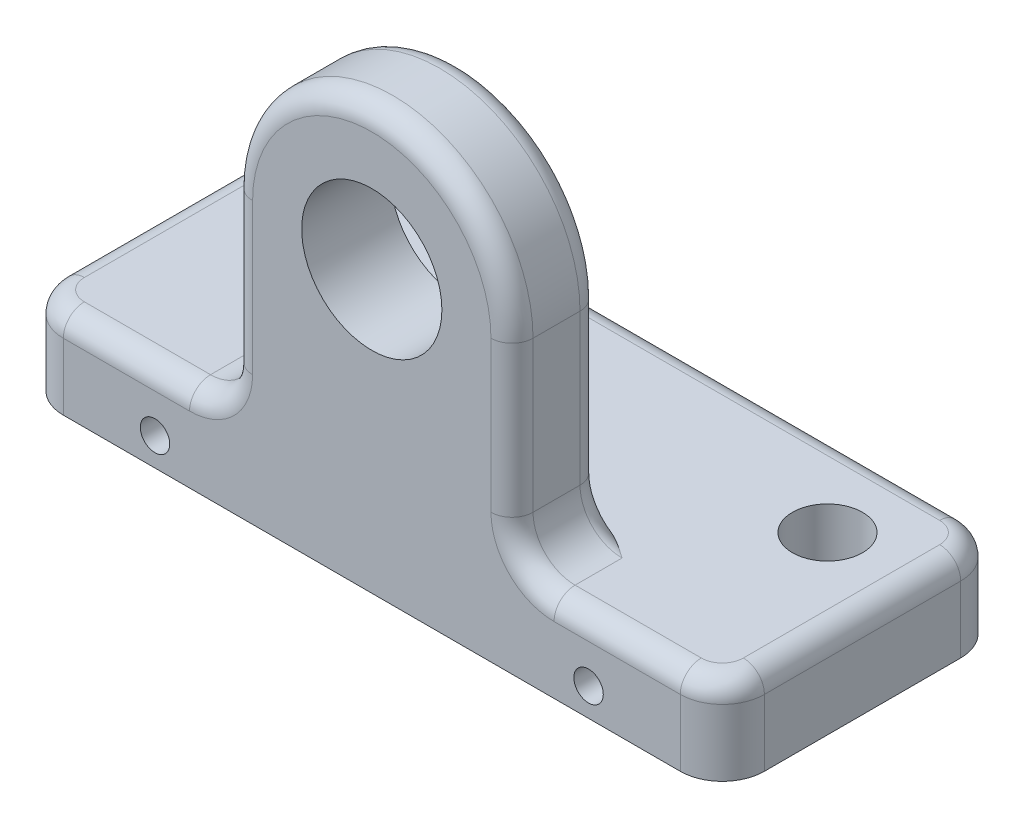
ISO-10303-21;
HEADER;
FILE_DESCRIPTION(('STEP AP214'),'2;1');
FILE_NAME('part.step','',(''),(''),'','','');
FILE_SCHEMA(('AUTOMOTIVE_DESIGN { 1 0 10303 214 1 1 1 1 }'));
ENDSEC;
DATA;
#1=APPLICATION_CONTEXT('core data for automotive mechanical design processes');
#2=APPLICATION_PROTOCOL_DEFINITION('international standard','automotive_design',2000,#1);
#3=PRODUCT_CONTEXT('',#1,'mechanical');
#4=PRODUCT('Part','Part','',(#3));
#5=PRODUCT_RELATED_PRODUCT_CATEGORY('part','',(#4));
#6=PRODUCT_DEFINITION_FORMATION('','',#4);
#7=PRODUCT_DEFINITION_CONTEXT('part definition',#1,'design');
#8=PRODUCT_DEFINITION('design','',#6,#7);
#9=PRODUCT_DEFINITION_SHAPE('','',#8);
#10=(LENGTH_UNIT() NAMED_UNIT(*) SI_UNIT(.MILLI.,.METRE.));
#11=(NAMED_UNIT(*) PLANE_ANGLE_UNIT() SI_UNIT($,.RADIAN.));
#12=(NAMED_UNIT(*) SI_UNIT($,.STERADIAN.) SOLID_ANGLE_UNIT());
#13=UNCERTAINTY_MEASURE_WITH_UNIT(LENGTH_MEASURE(1.E-05),#10,'distance_accuracy_value','');
#14=(GEOMETRIC_REPRESENTATION_CONTEXT(3) GLOBAL_UNCERTAINTY_ASSIGNED_CONTEXT((#13)) GLOBAL_UNIT_ASSIGNED_CONTEXT((#10,
#11,#12)) REPRESENTATION_CONTEXT('',''));
#15=CARTESIAN_POINT('',(0.,0.,0.));
#16=DIRECTION('',(0.,0.,1.));
#17=DIRECTION('',(1.,0.,0.));
#18=AXIS2_PLACEMENT_3D('',#15,#16,#17);
#19=CARTESIAN_POINT('',(-50.,12.5,-20.));
#20=DIRECTION('',(1.,0.,0.));
#21=DIRECTION('',(0.,0.,-1.));
#22=AXIS2_PLACEMENT_3D('',#19,#20,#21);
#23=PLANE('',#22);
#24=DIRECTION('',(0.,-1.,0.));
#25=VECTOR('',#24,1.);
#26=CARTESIAN_POINT('',(-50.,12.5,14.));
#27=LINE('',#26,#25);
#28=CARTESIAN_POINT('',(-50.,0.,14.));
#29=VERTEX_POINT('',#28);
#30=CARTESIAN_POINT('',(-50.,9.5,14.));
#31=VERTEX_POINT('',#30);
#32=EDGE_CURVE('E654',#29,#31,#27,.F.);
#33=ORIENTED_EDGE('',*,*,#32,.T.);
#34=DIRECTION('',(0.,0.,1.));
#35=VECTOR('',#34,1.);
#36=CARTESIAN_POINT('',(-50.,9.5,-14.));
#37=LINE('',#36,#35);
#38=CARTESIAN_POINT('',(-50.,9.5,-14.));
#39=VERTEX_POINT('',#38);
#40=EDGE_CURVE('E707',#31,#39,#37,.F.);
#41=ORIENTED_EDGE('',*,*,#40,.T.);
#42=DIRECTION('',(0.,-1.,0.));
#43=VECTOR('',#42,1.);
#44=CARTESIAN_POINT('',(-50.,12.5,-14.));
#45=LINE('',#44,#43);
#46=CARTESIAN_POINT('',(-50.,0.,-14.));
#47=VERTEX_POINT('',#46);
#48=EDGE_CURVE('E652',#39,#47,#45,.T.);
#49=ORIENTED_EDGE('',*,*,#48,.T.);
#50=DIRECTION('',(0.,0.,1.));
#51=VECTOR('',#50,1.);
#52=CARTESIAN_POINT('',(-50.,0.,-20.));
#53=LINE('',#52,#51);
#54=EDGE_CURVE('E611',#47,#29,#53,.T.);
#55=ORIENTED_EDGE('',*,*,#54,.T.);
#56=EDGE_LOOP('',(#33,#41,#49,#55));
#57=FACE_BOUND('',#56,.T.);
#58=ADVANCED_FACE('F351',(#57),#23,.F.);
#59=CARTESIAN_POINT('',(-50.,12.5,20.));
#60=DIRECTION('',(0.,0.,-1.));
#61=DIRECTION('',(-1.,0.,0.));
#62=AXIS2_PLACEMENT_3D('',#59,#60,#61);
#63=PLANE('',#62);
#64=CARTESIAN_POINT('',(-30.9212159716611,4.,20.));
#65=DIRECTION('',(0.,0.,1.));
#66=DIRECTION('',(1.,0.,0.));
#67=AXIS2_PLACEMENT_3D('',#64,#65,#66);
#68=CIRCLE('',#67,2.09999999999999);
#69=CARTESIAN_POINT('',(-28.8212159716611,4.,20.));
#70=VERTEX_POINT('',#69);
#71=EDGE_CURVE('E526',#70,#70,#68,.T.);
#72=ORIENTED_EDGE('',*,*,#71,.F.);
#73=EDGE_LOOP('',(#72));
#74=FACE_BOUND('',#73,.T.);
#75=CARTESIAN_POINT('',(30.9212159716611,4.,20.));
#76=DIRECTION('',(0.,0.,1.));
#77=DIRECTION('',(1.,0.,0.));
#78=AXIS2_PLACEMENT_3D('',#75,#76,#77);
#79=CIRCLE('',#78,2.09999999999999);
#80=CARTESIAN_POINT('',(33.0212159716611,4.,20.));
#81=VERTEX_POINT('',#80);
#82=EDGE_CURVE('E534',#81,#81,#79,.T.);
#83=ORIENTED_EDGE('',*,*,#82,.F.);
#84=EDGE_LOOP('',(#83));
#85=FACE_BOUND('',#84,.T.);
#86=CARTESIAN_POINT('',(0.,40.,20.));
#87=DIRECTION('',(0.,0.,1.));
#88=DIRECTION('',(1.,0.,0.));
#89=AXIS2_PLACEMENT_3D('',#86,#87,#88);
#90=CIRCLE('',#89,10.);
#91=CARTESIAN_POINT('',(10.,40.,20.));
#92=VERTEX_POINT('',#91);
#93=EDGE_CURVE('E549',#92,#92,#90,.T.);
#94=ORIENTED_EDGE('',*,*,#93,.F.);
#95=EDGE_LOOP('',(#94));
#96=FACE_BOUND('',#95,.T.);
#97=CARTESIAN_POINT('',(-26.,18.5,20.));
#98=DIRECTION('',(0.,0.,-1.));
#99=DIRECTION('',(-1.,0.,0.));
#100=AXIS2_PLACEMENT_3D('',#97,#98,#99);
#101=CIRCLE('',#100,9.);
#102=CARTESIAN_POINT('',(-17.,18.5,20.));
#103=VERTEX_POINT('',#102);
#104=CARTESIAN_POINT('',(-26.,9.5,20.));
#105=VERTEX_POINT('',#104);
#106=EDGE_CURVE('E679',#103,#105,#101,.T.);
#107=ORIENTED_EDGE('',*,*,#106,.T.);
#108=DIRECTION('',(1.,0.,0.));
#109=VECTOR('',#108,1.);
#110=CARTESIAN_POINT('',(-44.,9.5,20.));
#111=LINE('',#110,#109);
#112=CARTESIAN_POINT('',(-44.,9.5,20.));
#113=VERTEX_POINT('',#112);
#114=EDGE_CURVE('E681',#105,#113,#111,.F.);
#115=ORIENTED_EDGE('',*,*,#114,.T.);
#116=DIRECTION('',(0.,-1.,0.));
#117=VECTOR('',#116,1.);
#118=CARTESIAN_POINT('',(-44.,12.5,20.));
#119=LINE('',#118,#117);
#120=CARTESIAN_POINT('',(-44.,0.,20.));
#121=VERTEX_POINT('',#120);
#122=EDGE_CURVE('E636',#113,#121,#119,.T.);
#123=ORIENTED_EDGE('',*,*,#122,.T.);
#124=DIRECTION('',(1.,0.,0.));
#125=VECTOR('',#124,1.);
#126=CARTESIAN_POINT('',(-50.,0.,20.));
#127=LINE('',#126,#125);
#128=CARTESIAN_POINT('',(44.,0.,20.));
#129=VERTEX_POINT('',#128);
#130=EDGE_CURVE('E614',#121,#129,#127,.T.);
#131=ORIENTED_EDGE('',*,*,#130,.T.);
#132=DIRECTION('',(0.,-1.,0.));
#133=VECTOR('',#132,1.);
#134=CARTESIAN_POINT('',(44.,12.5,20.));
#135=LINE('',#134,#133);
#136=CARTESIAN_POINT('',(44.,9.5,20.));
#137=VERTEX_POINT('',#136);
#138=EDGE_CURVE('E638',#129,#137,#135,.F.);
#139=ORIENTED_EDGE('',*,*,#138,.T.);
#140=DIRECTION('',(1.,0.,0.));
#141=VECTOR('',#140,1.);
#142=CARTESIAN_POINT('',(26.,9.5,20.));
#143=LINE('',#142,#141);
#144=CARTESIAN_POINT('',(26.,9.5,20.));
#145=VERTEX_POINT('',#144);
#146=EDGE_CURVE('E674',#137,#145,#143,.F.);
#147=ORIENTED_EDGE('',*,*,#146,.T.);
#148=CARTESIAN_POINT('',(26.,18.5,20.));
#149=DIRECTION('',(0.,0.,-1.));
#150=DIRECTION('',(-1.,0.,0.));
#151=AXIS2_PLACEMENT_3D('',#148,#149,#150);
#152=CIRCLE('',#151,9.);
#153=CARTESIAN_POINT('',(17.,18.5,20.));
#154=VERTEX_POINT('',#153);
#155=EDGE_CURVE('E672',#145,#154,#152,.T.);
#156=ORIENTED_EDGE('',*,*,#155,.T.);
#157=DIRECTION('',(0.,-1.,0.));
#158=VECTOR('',#157,1.);
#159=CARTESIAN_POINT('',(17.,12.5,20.));
#160=LINE('',#159,#158);
#161=CARTESIAN_POINT('',(17.,40.,20.));
#162=VERTEX_POINT('',#161);
#163=EDGE_CURVE('E670',#154,#162,#160,.F.);
#164=ORIENTED_EDGE('',*,*,#163,.T.);
#165=CARTESIAN_POINT('',(0.,40.,20.));
#166=DIRECTION('',(0.,0.,-1.));
#167=DIRECTION('',(-1.,0.,0.));
#168=AXIS2_PLACEMENT_3D('',#165,#166,#167);
#169=CIRCLE('',#168,17.);
#170=CARTESIAN_POINT('',(-17.,40.,20.));
#171=VERTEX_POINT('',#170);
#172=EDGE_CURVE('E668',#162,#171,#169,.F.);
#173=ORIENTED_EDGE('',*,*,#172,.T.);
#174=DIRECTION('',(0.,1.,0.));
#175=VECTOR('',#174,1.);
#176=CARTESIAN_POINT('',(-17.,12.5,20.));
#177=LINE('',#176,#175);
#178=EDGE_CURVE('E676',#171,#103,#177,.F.);
#179=ORIENTED_EDGE('',*,*,#178,.T.);
#180=EDGE_LOOP('',(#107,#115,#123,#131,#139,#147,#156,#164,#173,#179));
#181=FACE_BOUND('',#180,.T.);
#182=ADVANCED_FACE('F883',(#74,#85,#96,#181),#63,.F.);
#183=CARTESIAN_POINT('',(50.,12.5,-20.));
#184=DIRECTION('',(-1.,0.,0.));
#185=DIRECTION('',(0.,0.,1.));
#186=AXIS2_PLACEMENT_3D('',#183,#184,#185);
#187=PLANE('',#186);
#188=DIRECTION('',(0.,-1.,0.));
#189=VECTOR('',#188,1.);
#190=CARTESIAN_POINT('',(50.,12.5,-14.));
#191=LINE('',#190,#189);
#192=CARTESIAN_POINT('',(50.,0.,-14.));
#193=VERTEX_POINT('',#192);
#194=CARTESIAN_POINT('',(50.,9.5,-14.));
#195=VERTEX_POINT('',#194);
#196=EDGE_CURVE('E623',#193,#195,#191,.F.);
#197=ORIENTED_EDGE('',*,*,#196,.T.);
#198=DIRECTION('',(0.,0.,-1.));
#199=VECTOR('',#198,1.);
#200=CARTESIAN_POINT('',(50.,9.5,14.));
#201=LINE('',#200,#199);
#202=CARTESIAN_POINT('',(50.,9.5,14.));
#203=VERTEX_POINT('',#202);
#204=EDGE_CURVE('E715',#195,#203,#201,.F.);
#205=ORIENTED_EDGE('',*,*,#204,.T.);
#206=DIRECTION('',(0.,-1.,0.));
#207=VECTOR('',#206,1.);
#208=CARTESIAN_POINT('',(50.,12.5,14.));
#209=LINE('',#208,#207);
#210=CARTESIAN_POINT('',(50.,0.,14.));
#211=VERTEX_POINT('',#210);
#212=EDGE_CURVE('E626',#203,#211,#209,.T.);
#213=ORIENTED_EDGE('',*,*,#212,.T.);
#214=DIRECTION('',(0.,0.,-1.));
#215=VECTOR('',#214,1.);
#216=CARTESIAN_POINT('',(50.,0.,-20.));
#217=LINE('',#216,#215);
#218=EDGE_CURVE('E617',#211,#193,#217,.T.);
#219=ORIENTED_EDGE('',*,*,#218,.T.);
#220=EDGE_LOOP('',(#197,#205,#213,#219));
#221=FACE_BOUND('',#220,.T.);
#222=ADVANCED_FACE('F889',(#221),#187,.F.);
#223=CARTESIAN_POINT('',(-50.,12.5,-20.));
#224=DIRECTION('',(0.,0.,1.));
#225=DIRECTION('',(1.,0.,0.));
#226=AXIS2_PLACEMENT_3D('',#223,#224,#225);
#227=PLANE('',#226);
#228=DIRECTION('',(0.,-1.,0.));
#229=VECTOR('',#228,1.);
#230=CARTESIAN_POINT('',(-44.,12.5,-20.));
#231=LINE('',#230,#229);
#232=CARTESIAN_POINT('',(-44.,0.,-20.));
#233=VERTEX_POINT('',#232);
#234=CARTESIAN_POINT('',(-44.,9.5,-20.));
#235=VERTEX_POINT('',#234);
#236=EDGE_CURVE('E647',#233,#235,#231,.F.);
#237=ORIENTED_EDGE('',*,*,#236,.T.);
#238=DIRECTION('',(-1.,0.,0.));
#239=VECTOR('',#238,1.);
#240=CARTESIAN_POINT('',(44.,9.5,-20.));
#241=LINE('',#240,#239);
#242=CARTESIAN_POINT('',(44.,9.5,-20.));
#243=VERTEX_POINT('',#242);
#244=EDGE_CURVE('E711',#235,#243,#241,.F.);
#245=ORIENTED_EDGE('',*,*,#244,.T.);
#246=DIRECTION('',(0.,-1.,0.));
#247=VECTOR('',#246,1.);
#248=CARTESIAN_POINT('',(44.,12.5,-20.));
#249=LINE('',#248,#247);
#250=CARTESIAN_POINT('',(44.,0.,-20.));
#251=VERTEX_POINT('',#250);
#252=EDGE_CURVE('E650',#243,#251,#249,.T.);
#253=ORIENTED_EDGE('',*,*,#252,.T.);
#254=DIRECTION('',(-1.,0.,0.));
#255=VECTOR('',#254,1.);
#256=CARTESIAN_POINT('',(-50.,0.,-20.));
#257=LINE('',#256,#255);
#258=EDGE_CURVE('E620',#251,#233,#257,.T.);
#259=ORIENTED_EDGE('',*,*,#258,.T.);
#260=EDGE_LOOP('',(#237,#245,#253,#259));
#261=FACE_BOUND('',#260,.T.);
#262=ADVANCED_FACE('F879',(#261),#227,.F.);
#263=CARTESIAN_POINT('',(-50.,12.5,20.));
#264=DIRECTION('',(0.,1.,0.));
#265=DIRECTION('',(0.,0.,1.));
#266=AXIS2_PLACEMENT_3D('',#263,#264,#265);
#267=PLANE('',#266);
#268=CARTESIAN_POINT('',(-37.5,12.5,-7.49999999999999));
#269=DIRECTION('',(0.,1.,0.));
#270=DIRECTION('',(0.,0.,1.));
#271=AXIS2_PLACEMENT_3D('',#268,#269,#270);
#272=CIRCLE('',#271,5.);
#273=CARTESIAN_POINT('',(-37.5,12.5,-2.5));
#274=VERTEX_POINT('',#273);
#275=EDGE_CURVE('E537',#274,#274,#272,.T.);
#276=ORIENTED_EDGE('',*,*,#275,.F.);
#277=EDGE_LOOP('',(#276));
#278=FACE_BOUND('',#277,.T.);
#279=CARTESIAN_POINT('',(37.5,12.5,-7.50000000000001));
#280=DIRECTION('',(0.,1.,0.));
#281=DIRECTION('',(0.,0.,1.));
#282=AXIS2_PLACEMENT_3D('',#279,#280,#281);
#283=CIRCLE('',#282,5.);
#284=CARTESIAN_POINT('',(37.5,12.5,-2.50000000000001));
#285=VERTEX_POINT('',#284);
#286=EDGE_CURVE('E543',#285,#285,#283,.T.);
#287=ORIENTED_EDGE('',*,*,#286,.F.);
#288=EDGE_LOOP('',(#287));
#289=FACE_BOUND('',#288,.T.);
#290=CARTESIAN_POINT('',(-44.,12.5,14.));
#291=DIRECTION('',(0.,1.,0.));
#292=DIRECTION('',(0.,0.,1.));
#293=AXIS2_PLACEMENT_3D('',#290,#291,#292);
#294=CIRCLE('',#293,3.);
#295=CARTESIAN_POINT('',(-47.,12.5,14.));
#296=VERTEX_POINT('',#295);
#297=CARTESIAN_POINT('',(-44.,12.5,17.));
#298=VERTEX_POINT('',#297);
#299=EDGE_CURVE('E701',#296,#298,#294,.T.);
#300=ORIENTED_EDGE('',*,*,#299,.T.);
#301=DIRECTION('',(1.,0.,0.));
#302=VECTOR('',#301,1.);
#303=CARTESIAN_POINT('',(-26.,12.5,17.));
#304=LINE('',#303,#302);
#305=CARTESIAN_POINT('',(-26.,12.5,17.));
#306=VERTEX_POINT('',#305);
#307=EDGE_CURVE('E703',#298,#306,#304,.T.);
#308=ORIENTED_EDGE('',*,*,#307,.T.);
#309=DIRECTION('',(0.,0.,1.));
#310=VECTOR('',#309,1.);
#311=CARTESIAN_POINT('',(-26.,12.5,20.));
#312=LINE('',#311,#310);
#313=CARTESIAN_POINT('',(-26.,12.5,10.3));
#314=VERTEX_POINT('',#313);
#315=EDGE_CURVE('E644',#306,#314,#312,.F.);
#316=ORIENTED_EDGE('',*,*,#315,.T.);
#317=CARTESIAN_POINT('',(-19.2917960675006,12.5,7.3));
#318=CARTESIAN_POINT('',(-19.4699847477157,12.5,7.30001536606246));
#319=CARTESIAN_POINT('',(-19.6479605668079,12.5,7.30881435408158));
#320=CARTESIAN_POINT('',(-20.0021021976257,12.5,7.34213005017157));
#321=CARTESIAN_POINT('',(-20.1782709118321,12.5,7.36661536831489));
#322=CARTESIAN_POINT('',(-20.6971961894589,12.5,7.45984128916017));
#323=CARTESIAN_POINT('',(-21.0364046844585,12.5,7.54848248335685));
#324=CARTESIAN_POINT('',(-21.7323783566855,12.5,7.77705288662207));
#325=CARTESIAN_POINT('',(-22.0877437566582,12.5,7.92105909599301));
#326=CARTESIAN_POINT('',(-22.7822471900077,12.5,8.24436110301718));
#327=CARTESIAN_POINT('',(-23.1213600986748,12.5,8.42370947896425));
#328=CARTESIAN_POINT('',(-23.7887153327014,12.5,8.80771609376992));
#329=CARTESIAN_POINT('',(-24.1168315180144,12.5,9.01258868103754));
#330=CARTESIAN_POINT('',(-24.7635387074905,12.5,9.43627356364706));
#331=CARTESIAN_POINT('',(-25.0821339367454,12.5,9.65507953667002));
#332=CARTESIAN_POINT('',(-25.5955053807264,12.5,10.0140134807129));
#333=CARTESIAN_POINT('',(-25.7914347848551,12.5,10.1525228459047));
#334=CARTESIAN_POINT('',(-25.991567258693,12.5,10.2940371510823));
#335=CARTESIAN_POINT('',(-25.9957836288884,12.5,10.2970185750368));
#336=CARTESIAN_POINT('',(-26.,12.5,10.3));
#337=B_SPLINE_CURVE_WITH_KNOTS('',3,(#317,#318,#319,#320,#321,#322,#323,#324,#325,#326,#327,
#328,#329,#330,#331,#332,#333,#334,#335,#336),.UNSPECIFIED.,.F.,.F.,(4,2,2,2,2,2,2,2,2,4),(0.,
0.534020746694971,1.06697618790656,2.11500888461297,3.26274547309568,4.41220261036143,
5.57206146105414,6.73139772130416,7.45123837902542,7.46673031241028),.UNSPECIFIED.);
#338=CARTESIAN_POINT('',(-19.2917960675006,12.5,7.3));
#339=VERTEX_POINT('',#338);
#340=EDGE_CURVE('E359',#314,#339,#337,.F.);
#341=ORIENTED_EDGE('',*,*,#340,.T.);
#342=DIRECTION('',(-1.,0.,0.));
#343=VECTOR('',#342,1.);
#344=CARTESIAN_POINT('',(20.,12.5,7.3));
#345=LINE('',#344,#343);
#346=CARTESIAN_POINT('',(19.2917960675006,12.5,7.3));
#347=VERTEX_POINT('',#346);
#348=EDGE_CURVE('E602',#347,#339,#345,.T.);
#349=ORIENTED_EDGE('',*,*,#348,.F.);
#350=CARTESIAN_POINT('',(19.2917960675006,12.5,7.3));
#351=CARTESIAN_POINT('',(19.4699847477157,12.5,7.30001536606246));
#352=CARTESIAN_POINT('',(19.6479605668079,12.5,7.30881435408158));
#353=CARTESIAN_POINT('',(20.0021021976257,12.5,7.34213005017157));
#354=CARTESIAN_POINT('',(20.1782709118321,12.5,7.36661536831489));
#355=CARTESIAN_POINT('',(20.6971961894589,12.5,7.45984128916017));
#356=CARTESIAN_POINT('',(21.0364046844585,12.5,7.54848248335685));
#357=CARTESIAN_POINT('',(21.7323783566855,12.5,7.77705288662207));
#358=CARTESIAN_POINT('',(22.0877437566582,12.5,7.92105909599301));
#359=CARTESIAN_POINT('',(22.7822471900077,12.5,8.24436110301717));
#360=CARTESIAN_POINT('',(23.1213600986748,12.5,8.42370947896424));
#361=CARTESIAN_POINT('',(23.7887153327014,12.5,8.80771609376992));
#362=CARTESIAN_POINT('',(24.1168315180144,12.5,9.01258868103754));
#363=CARTESIAN_POINT('',(24.7635387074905,12.5,9.43627356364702));
#364=CARTESIAN_POINT('',(25.0821339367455,12.5,9.65507953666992));
#365=CARTESIAN_POINT('',(25.5955053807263,12.5,10.014013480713));
#366=CARTESIAN_POINT('',(25.791434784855,12.5,10.1525228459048));
#367=CARTESIAN_POINT('',(25.991567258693,12.5,10.2940371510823));
#368=CARTESIAN_POINT('',(25.9957836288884,12.5,10.2970185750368));
#369=CARTESIAN_POINT('',(26.,12.5,10.3));
#370=B_SPLINE_CURVE_WITH_KNOTS('',3,(#350,#351,#352,#353,#354,#355,#356,#357,#358,#359,#360,
#361,#362,#363,#364,#365,#366,#367,#368,#369),.UNSPECIFIED.,.F.,.F.,(4,2,2,2,2,2,2,2,2,4),(0.,
0.534020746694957,1.06697618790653,2.11500888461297,3.26274547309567,4.41220261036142,
5.57206146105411,6.7313977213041,7.45123837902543,7.46673031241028),.UNSPECIFIED.);
#371=CARTESIAN_POINT('',(26.,12.5,10.3));
#372=VERTEX_POINT('',#371);
#373=EDGE_CURVE('E11',#347,#372,#370,.T.);
#374=ORIENTED_EDGE('',*,*,#373,.T.);
#375=DIRECTION('',(0.,0.,1.));
#376=VECTOR('',#375,1.);
#377=CARTESIAN_POINT('',(26.,12.5,20.));
#378=LINE('',#377,#376);
#379=CARTESIAN_POINT('',(26.,12.5,17.));
#380=VERTEX_POINT('',#379);
#381=EDGE_CURVE('E641',#372,#380,#378,.T.);
#382=ORIENTED_EDGE('',*,*,#381,.T.);
#383=DIRECTION('',(1.,0.,0.));
#384=VECTOR('',#383,1.);
#385=CARTESIAN_POINT('',(44.,12.5,17.));
#386=LINE('',#385,#384);
#387=CARTESIAN_POINT('',(44.,12.5,17.));
#388=VERTEX_POINT('',#387);
#389=EDGE_CURVE('E687',#380,#388,#386,.T.);
#390=ORIENTED_EDGE('',*,*,#389,.T.);
#391=CARTESIAN_POINT('',(44.,12.5,14.));
#392=DIRECTION('',(0.,1.,0.));
#393=DIRECTION('',(0.,0.,1.));
#394=AXIS2_PLACEMENT_3D('',#391,#392,#393);
#395=CIRCLE('',#394,3.);
#396=CARTESIAN_POINT('',(47.,12.5,14.));
#397=VERTEX_POINT('',#396);
#398=EDGE_CURVE('E689',#388,#397,#395,.T.);
#399=ORIENTED_EDGE('',*,*,#398,.T.);
#400=DIRECTION('',(0.,0.,-1.));
#401=VECTOR('',#400,1.);
#402=CARTESIAN_POINT('',(47.,12.5,-14.));
#403=LINE('',#402,#401);
#404=CARTESIAN_POINT('',(47.,12.5,-14.));
#405=VERTEX_POINT('',#404);
#406=EDGE_CURVE('E691',#397,#405,#403,.T.);
#407=ORIENTED_EDGE('',*,*,#406,.T.);
#408=CARTESIAN_POINT('',(44.,12.5,-14.));
#409=DIRECTION('',(0.,1.,0.));
#410=DIRECTION('',(0.,0.,1.));
#411=AXIS2_PLACEMENT_3D('',#408,#409,#410);
#412=CIRCLE('',#411,3.);
#413=CARTESIAN_POINT('',(44.,12.5,-17.));
#414=VERTEX_POINT('',#413);
#415=EDGE_CURVE('E693',#405,#414,#412,.T.);
#416=ORIENTED_EDGE('',*,*,#415,.T.);
#417=DIRECTION('',(-1.,0.,0.));
#418=VECTOR('',#417,1.);
#419=CARTESIAN_POINT('',(-44.,12.5,-17.));
#420=LINE('',#419,#418);
#421=CARTESIAN_POINT('',(-44.,12.5,-17.));
#422=VERTEX_POINT('',#421);
#423=EDGE_CURVE('E695',#414,#422,#420,.T.);
#424=ORIENTED_EDGE('',*,*,#423,.T.);
#425=CARTESIAN_POINT('',(-44.,12.5,-14.));
#426=DIRECTION('',(0.,1.,0.));
#427=DIRECTION('',(0.,0.,1.));
#428=AXIS2_PLACEMENT_3D('',#425,#426,#427);
#429=CIRCLE('',#428,3.);
#430=CARTESIAN_POINT('',(-47.,12.5,-14.));
#431=VERTEX_POINT('',#430);
#432=EDGE_CURVE('E697',#422,#431,#429,.T.);
#433=ORIENTED_EDGE('',*,*,#432,.T.);
#434=DIRECTION('',(0.,0.,1.));
#435=VECTOR('',#434,1.);
#436=CARTESIAN_POINT('',(-47.,12.5,14.));
#437=LINE('',#436,#435);
#438=EDGE_CURVE('E699',#431,#296,#437,.T.);
#439=ORIENTED_EDGE('',*,*,#438,.T.);
#440=EDGE_LOOP('',(#300,#308,#316,#341,#349,#374,#382,#390,#399,#407,#416,#424,#433,#439));
#441=FACE_BOUND('',#440,.T.);
#442=ADVANCED_FACE('F750',(#278,#289,#441),#267,.T.);
#443=CARTESIAN_POINT('',(-50.,0.,20.));
#444=DIRECTION('',(0.,1.,0.));
#445=DIRECTION('',(0.,0.,1.));
#446=AXIS2_PLACEMENT_3D('',#443,#444,#445);
#447=PLANE('',#446);
#448=CARTESIAN_POINT('',(-37.5,0.,-7.49999999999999));
#449=DIRECTION('',(0.,1.,0.));
#450=DIRECTION('',(0.,0.,1.));
#451=AXIS2_PLACEMENT_3D('',#448,#449,#450);
#452=CIRCLE('',#451,5.);
#453=CARTESIAN_POINT('',(-37.5,0.,-2.5));
#454=VERTEX_POINT('',#453);
#455=EDGE_CURVE('E540',#454,#454,#452,.T.);
#456=ORIENTED_EDGE('',*,*,#455,.T.);
#457=EDGE_LOOP('',(#456));
#458=FACE_BOUND('',#457,.T.);
#459=CARTESIAN_POINT('',(37.5,0.,-7.50000000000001));
#460=DIRECTION('',(0.,1.,0.));
#461=DIRECTION('',(0.,0.,1.));
#462=AXIS2_PLACEMENT_3D('',#459,#460,#461);
#463=CIRCLE('',#462,5.);
#464=CARTESIAN_POINT('',(37.5,0.,-2.50000000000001));
#465=VERTEX_POINT('',#464);
#466=EDGE_CURVE('E546',#465,#465,#463,.T.);
#467=ORIENTED_EDGE('',*,*,#466,.T.);
#468=EDGE_LOOP('',(#467));
#469=FACE_BOUND('',#468,.T.);
#470=ORIENTED_EDGE('',*,*,#218,.F.);
#471=CARTESIAN_POINT('',(44.,0.,14.));
#472=DIRECTION('',(0.,1.,0.));
#473=DIRECTION('',(0.,0.,1.));
#474=AXIS2_PLACEMENT_3D('',#471,#472,#473);
#475=CIRCLE('',#474,6.);
#476=EDGE_CURVE('E634',#211,#129,#475,.F.);
#477=ORIENTED_EDGE('',*,*,#476,.T.);
#478=ORIENTED_EDGE('',*,*,#130,.F.);
#479=CARTESIAN_POINT('',(-44.,0.,14.));
#480=DIRECTION('',(0.,1.,0.));
#481=DIRECTION('',(0.,0.,1.));
#482=AXIS2_PLACEMENT_3D('',#479,#480,#481);
#483=CIRCLE('',#482,6.);
#484=EDGE_CURVE('E630',#121,#29,#483,.F.);
#485=ORIENTED_EDGE('',*,*,#484,.T.);
#486=ORIENTED_EDGE('',*,*,#54,.F.);
#487=CARTESIAN_POINT('',(-44.,0.,-14.));
#488=DIRECTION('',(0.,1.,0.));
#489=DIRECTION('',(0.,0.,1.));
#490=AXIS2_PLACEMENT_3D('',#487,#488,#489);
#491=CIRCLE('',#490,6.);
#492=EDGE_CURVE('E628',#47,#233,#491,.F.);
#493=ORIENTED_EDGE('',*,*,#492,.T.);
#494=ORIENTED_EDGE('',*,*,#258,.F.);
#495=CARTESIAN_POINT('',(44.,0.,-14.));
#496=DIRECTION('',(0.,1.,0.));
#497=DIRECTION('',(0.,0.,1.));
#498=AXIS2_PLACEMENT_3D('',#495,#496,#497);
#499=CIRCLE('',#498,6.);
#500=EDGE_CURVE('E632',#251,#193,#499,.F.);
#501=ORIENTED_EDGE('',*,*,#500,.T.);
#502=EDGE_LOOP('',(#470,#477,#478,#485,#486,#493,#494,#501));
#503=FACE_BOUND('',#502,.T.);
#504=ADVANCED_FACE('F871',(#458,#469,#503),#447,.F.);
#505=CARTESIAN_POINT('',(-20.,12.5,7.3));
#506=DIRECTION('',(1.,0.,0.));
#507=DIRECTION('',(0.,1.,0.));
#508=AXIS2_PLACEMENT_3D('',#505,#506,#507);
#509=PLANE('',#508);
#510=DIRECTION('',(0.,0.,1.));
#511=VECTOR('',#510,1.);
#512=CARTESIAN_POINT('',(-20.,18.5,7.3));
#513=LINE('',#512,#511);
#514=CARTESIAN_POINT('',(-20.,18.5,10.3));
#515=VERTEX_POINT('',#514);
#516=CARTESIAN_POINT('',(-20.,18.5,17.));
#517=VERTEX_POINT('',#516);
#518=EDGE_CURVE('E657',#515,#517,#513,.T.);
#519=ORIENTED_EDGE('',*,*,#518,.T.);
#520=DIRECTION('',(0.,1.,0.));
#521=VECTOR('',#520,1.);
#522=CARTESIAN_POINT('',(-20.,12.5,17.));
#523=LINE('',#522,#521);
#524=CARTESIAN_POINT('',(-20.,40.,17.));
#525=VERTEX_POINT('',#524);
#526=EDGE_CURVE('E665',#517,#525,#523,.T.);
#527=ORIENTED_EDGE('',*,*,#526,.T.);
#528=DIRECTION('',(0.,0.,1.));
#529=VECTOR('',#528,1.);
#530=CARTESIAN_POINT('',(-20.,40.,7.3));
#531=LINE('',#530,#529);
#532=CARTESIAN_POINT('',(-20.,40.,10.3));
#533=VERTEX_POINT('',#532);
#534=EDGE_CURVE('E608',#533,#525,#531,.T.);
#535=ORIENTED_EDGE('',*,*,#534,.F.);
#536=DIRECTION('',(0.,1.,0.));
#537=VECTOR('',#536,1.);
#538=CARTESIAN_POINT('',(-20.,18.5,10.3));
#539=LINE('',#538,#537);
#540=EDGE_CURVE('E663',#533,#515,#539,.F.);
#541=ORIENTED_EDGE('',*,*,#540,.T.);
#542=EDGE_LOOP('',(#519,#527,#535,#541));
#543=FACE_BOUND('',#542,.T.);
#544=ADVANCED_FACE('F868',(#543),#509,.F.);
#545=CARTESIAN_POINT('',(0.,40.,7.3));
#546=DIRECTION('',(0.,0.,1.));
#547=DIRECTION('',(1.,0.,0.));
#548=AXIS2_PLACEMENT_3D('',#545,#546,#547);
#549=CYLINDRICAL_SURFACE('',#548,20.);
#550=ORIENTED_EDGE('',*,*,#534,.T.);
#551=CARTESIAN_POINT('',(0.,40.,17.));
#552=DIRECTION('',(0.,0.,-1.));
#553=DIRECTION('',(-1.,0.,0.));
#554=AXIS2_PLACEMENT_3D('',#551,#552,#553);
#555=CIRCLE('',#554,20.);
#556=CARTESIAN_POINT('',(20.,40.,17.));
#557=VERTEX_POINT('',#556);
#558=EDGE_CURVE('E739',#525,#557,#555,.T.);
#559=ORIENTED_EDGE('',*,*,#558,.T.);
#560=DIRECTION('',(0.,0.,1.));
#561=VECTOR('',#560,1.);
#562=CARTESIAN_POINT('',(20.,40.,7.3));
#563=LINE('',#562,#561);
#564=CARTESIAN_POINT('',(20.,40.,10.3));
#565=VERTEX_POINT('',#564);
#566=EDGE_CURVE('E605',#565,#557,#563,.T.);
#567=ORIENTED_EDGE('',*,*,#566,.F.);
#568=CARTESIAN_POINT('',(0.,40.,10.3));
#569=DIRECTION('',(0.,0.,-1.));
#570=DIRECTION('',(-1.,0.,0.));
#571=AXIS2_PLACEMENT_3D('',#568,#569,#570);
#572=CIRCLE('',#571,20.);
#573=EDGE_CURVE('E737',#565,#533,#572,.F.);
#574=ORIENTED_EDGE('',*,*,#573,.T.);
#575=EDGE_LOOP('',(#550,#559,#567,#574));
#576=FACE_BOUND('',#575,.T.);
#577=ADVANCED_FACE('F864',(#576),#549,.T.);
#578=CARTESIAN_POINT('',(20.,40.,7.3));
#579=DIRECTION('',(-1.,0.,0.));
#580=DIRECTION('',(0.,-1.,0.));
#581=AXIS2_PLACEMENT_3D('',#578,#579,#580);
#582=PLANE('',#581);
#583=ORIENTED_EDGE('',*,*,#566,.T.);
#584=DIRECTION('',(0.,-1.,0.));
#585=VECTOR('',#584,1.);
#586=CARTESIAN_POINT('',(20.,40.,17.));
#587=LINE('',#586,#585);
#588=CARTESIAN_POINT('',(20.,18.5,17.));
#589=VERTEX_POINT('',#588);
#590=EDGE_CURVE('E725',#557,#589,#587,.T.);
#591=ORIENTED_EDGE('',*,*,#590,.T.);
#592=DIRECTION('',(0.,0.,1.));
#593=VECTOR('',#592,1.);
#594=CARTESIAN_POINT('',(20.,18.5,7.3));
#595=LINE('',#594,#593);
#596=CARTESIAN_POINT('',(20.,18.5,10.3));
#597=VERTEX_POINT('',#596);
#598=EDGE_CURVE('E660',#589,#597,#595,.F.);
#599=ORIENTED_EDGE('',*,*,#598,.T.);
#600=DIRECTION('',(0.,-1.,0.));
#601=VECTOR('',#600,1.);
#602=CARTESIAN_POINT('',(20.,40.,10.3));
#603=LINE('',#602,#601);
#604=EDGE_CURVE('E723',#597,#565,#603,.F.);
#605=ORIENTED_EDGE('',*,*,#604,.T.);
#606=EDGE_LOOP('',(#583,#591,#599,#605));
#607=FACE_BOUND('',#606,.T.);
#608=ADVANCED_FACE('F860',(#607),#582,.F.);
#609=CARTESIAN_POINT('',(0.,40.,7.3));
#610=DIRECTION('',(0.,0.,-1.));
#611=DIRECTION('',(-1.,0.,0.));
#612=AXIS2_PLACEMENT_3D('',#609,#610,#611);
#613=PLANE('',#612);
#614=CARTESIAN_POINT('',(0.,40.,7.3));
#615=DIRECTION('',(0.,0.,-1.));
#616=DIRECTION('',(-1.,0.,0.));
#617=AXIS2_PLACEMENT_3D('',#614,#615,#616);
#618=CIRCLE('',#617,10.);
#619=CARTESIAN_POINT('',(-10.,40.,7.3));
#620=VERTEX_POINT('',#619);
#621=EDGE_CURVE('E354',#620,#620,#618,.T.);
#622=ORIENTED_EDGE('',*,*,#621,.F.);
#623=EDGE_LOOP('',(#622));
#624=FACE_BOUND('',#623,.T.);
#625=ORIENTED_EDGE('',*,*,#348,.T.);
#626=CARTESIAN_POINT('',(-26.,18.5,7.3));
#627=DIRECTION('',(0.,0.,-1.));
#628=DIRECTION('',(-1.,0.,0.));
#629=AXIS2_PLACEMENT_3D('',#626,#627,#628);
#630=CIRCLE('',#629,9.);
#631=CARTESIAN_POINT('',(-17.,18.5,7.3));
#632=VERTEX_POINT('',#631);
#633=EDGE_CURVE('E734',#339,#632,#630,.F.);
#634=ORIENTED_EDGE('',*,*,#633,.T.);
#635=DIRECTION('',(0.,1.,0.));
#636=VECTOR('',#635,1.);
#637=CARTESIAN_POINT('',(-17.,40.,7.3));
#638=LINE('',#637,#636);
#639=CARTESIAN_POINT('',(-17.,40.,7.3));
#640=VERTEX_POINT('',#639);
#641=EDGE_CURVE('E732',#632,#640,#638,.T.);
#642=ORIENTED_EDGE('',*,*,#641,.T.);
#643=CARTESIAN_POINT('',(0.,40.,7.3));
#644=DIRECTION('',(0.,0.,-1.));
#645=DIRECTION('',(-1.,0.,0.));
#646=AXIS2_PLACEMENT_3D('',#643,#644,#645);
#647=CIRCLE('',#646,17.);
#648=CARTESIAN_POINT('',(17.,40.,7.3));
#649=VERTEX_POINT('',#648);
#650=EDGE_CURVE('E727',#640,#649,#647,.T.);
#651=ORIENTED_EDGE('',*,*,#650,.T.);
#652=DIRECTION('',(0.,-1.,0.));
#653=VECTOR('',#652,1.);
#654=CARTESIAN_POINT('',(17.,18.5,7.3));
#655=LINE('',#654,#653);
#656=CARTESIAN_POINT('',(17.,18.5,7.3));
#657=VERTEX_POINT('',#656);
#658=EDGE_CURVE('E374',#649,#657,#655,.T.);
#659=ORIENTED_EDGE('',*,*,#658,.T.);
#660=CARTESIAN_POINT('',(26.,18.5,7.3));
#661=DIRECTION('',(0.,0.,-1.));
#662=DIRECTION('',(-1.,0.,0.));
#663=AXIS2_PLACEMENT_3D('',#660,#661,#662);
#664=CIRCLE('',#663,9.);
#665=EDGE_CURVE('E730',#657,#347,#664,.F.);
#666=ORIENTED_EDGE('',*,*,#665,.T.);
#667=EDGE_LOOP('',(#625,#634,#642,#651,#659,#666));
#668=FACE_BOUND('',#667,.T.);
#669=ADVANCED_FACE('F856',(#624,#668),#613,.T.);
#670=CARTESIAN_POINT('',(44.,12.5,14.));
#671=DIRECTION('',(0.,-1.,0.));
#672=DIRECTION('',(0.,0.,-1.));
#673=AXIS2_PLACEMENT_3D('',#670,#671,#672);
#674=CYLINDRICAL_SURFACE('',#673,6.);
#675=ORIENTED_EDGE('',*,*,#212,.F.);
#676=CARTESIAN_POINT('',(44.,9.5,14.));
#677=DIRECTION('',(0.,1.,0.));
#678=DIRECTION('',(0.,0.,1.));
#679=AXIS2_PLACEMENT_3D('',#676,#677,#678);
#680=CIRCLE('',#679,6.);
#681=EDGE_CURVE('E717',#203,#137,#680,.F.);
#682=ORIENTED_EDGE('',*,*,#681,.T.);
#683=ORIENTED_EDGE('',*,*,#138,.F.);
#684=ORIENTED_EDGE('',*,*,#476,.F.);
#685=EDGE_LOOP('',(#675,#682,#683,#684));
#686=FACE_BOUND('',#685,.T.);
#687=ADVANCED_FACE('F852',(#686),#674,.T.);
#688=CARTESIAN_POINT('',(44.,12.5,-14.));
#689=DIRECTION('',(0.,-1.,0.));
#690=DIRECTION('',(0.,0.,-1.));
#691=AXIS2_PLACEMENT_3D('',#688,#689,#690);
#692=CYLINDRICAL_SURFACE('',#691,6.);
#693=ORIENTED_EDGE('',*,*,#252,.F.);
#694=CARTESIAN_POINT('',(44.,9.5,-14.));
#695=DIRECTION('',(0.,1.,0.));
#696=DIRECTION('',(0.,0.,1.));
#697=AXIS2_PLACEMENT_3D('',#694,#695,#696);
#698=CIRCLE('',#697,6.);
#699=EDGE_CURVE('E713',#243,#195,#698,.F.);
#700=ORIENTED_EDGE('',*,*,#699,.T.);
#701=ORIENTED_EDGE('',*,*,#196,.F.);
#702=ORIENTED_EDGE('',*,*,#500,.F.);
#703=EDGE_LOOP('',(#693,#700,#701,#702));
#704=FACE_BOUND('',#703,.T.);
#705=ADVANCED_FACE('F848',(#704),#692,.T.);
#706=CARTESIAN_POINT('',(-44.,12.5,14.));
#707=DIRECTION('',(0.,-1.,0.));
#708=DIRECTION('',(0.,0.,-1.));
#709=AXIS2_PLACEMENT_3D('',#706,#707,#708);
#710=CYLINDRICAL_SURFACE('',#709,6.);
#711=ORIENTED_EDGE('',*,*,#122,.F.);
#712=CARTESIAN_POINT('',(-44.,9.5,14.));
#713=DIRECTION('',(0.,1.,0.));
#714=DIRECTION('',(0.,0.,1.));
#715=AXIS2_PLACEMENT_3D('',#712,#713,#714);
#716=CIRCLE('',#715,6.);
#717=EDGE_CURVE('E705',#113,#31,#716,.F.);
#718=ORIENTED_EDGE('',*,*,#717,.T.);
#719=ORIENTED_EDGE('',*,*,#32,.F.);
#720=ORIENTED_EDGE('',*,*,#484,.F.);
#721=EDGE_LOOP('',(#711,#718,#719,#720));
#722=FACE_BOUND('',#721,.T.);
#723=ADVANCED_FACE('F844',(#722),#710,.T.);
#724=CARTESIAN_POINT('',(-44.,12.5,-14.));
#725=DIRECTION('',(0.,-1.,0.));
#726=DIRECTION('',(0.,0.,-1.));
#727=AXIS2_PLACEMENT_3D('',#724,#725,#726);
#728=CYLINDRICAL_SURFACE('',#727,6.);
#729=ORIENTED_EDGE('',*,*,#48,.F.);
#730=CARTESIAN_POINT('',(-44.,9.5,-14.));
#731=DIRECTION('',(0.,1.,0.));
#732=DIRECTION('',(0.,0.,1.));
#733=AXIS2_PLACEMENT_3D('',#730,#731,#732);
#734=CIRCLE('',#733,6.);
#735=EDGE_CURVE('E709',#39,#235,#734,.F.);
#736=ORIENTED_EDGE('',*,*,#735,.T.);
#737=ORIENTED_EDGE('',*,*,#236,.F.);
#738=ORIENTED_EDGE('',*,*,#492,.F.);
#739=EDGE_LOOP('',(#729,#736,#737,#738));
#740=FACE_BOUND('',#739,.T.);
#741=ADVANCED_FACE('F840',(#740),#728,.T.);
#742=CARTESIAN_POINT('',(-26.,18.5,7.3));
#743=DIRECTION('',(0.,0.,1.));
#744=DIRECTION('',(1.,0.,0.));
#745=AXIS2_PLACEMENT_3D('',#742,#743,#744);
#746=CYLINDRICAL_SURFACE('',#745,6.);
#747=ORIENTED_EDGE('',*,*,#315,.F.);
#748=CARTESIAN_POINT('',(-26.,18.5,17.));
#749=DIRECTION('',(0.,0.,-1.));
#750=DIRECTION('',(-1.,0.,0.));
#751=AXIS2_PLACEMENT_3D('',#748,#749,#750);
#752=CIRCLE('',#751,6.);
#753=EDGE_CURVE('E685',#306,#517,#752,.F.);
#754=ORIENTED_EDGE('',*,*,#753,.T.);
#755=ORIENTED_EDGE('',*,*,#518,.F.);
#756=CARTESIAN_POINT('',(-26.,18.5,10.3));
#757=DIRECTION('',(0.,0.,-1.));
#758=DIRECTION('',(-1.,0.,0.));
#759=AXIS2_PLACEMENT_3D('',#756,#757,#758);
#760=CIRCLE('',#759,6.);
#761=EDGE_CURVE('E683',#515,#314,#760,.T.);
#762=ORIENTED_EDGE('',*,*,#761,.T.);
#763=EDGE_LOOP('',(#747,#754,#755,#762));
#764=FACE_BOUND('',#763,.T.);
#765=ADVANCED_FACE('F836',(#764),#746,.F.);
#766=CARTESIAN_POINT('',(26.,18.5,20.));
#767=DIRECTION('',(0.,0.,1.));
#768=DIRECTION('',(1.,0.,0.));
#769=AXIS2_PLACEMENT_3D('',#766,#767,#768);
#770=CYLINDRICAL_SURFACE('',#769,6.);
#771=ORIENTED_EDGE('',*,*,#598,.F.);
#772=CARTESIAN_POINT('',(26.,18.5,17.));
#773=DIRECTION('',(0.,0.,-1.));
#774=DIRECTION('',(-1.,0.,0.));
#775=AXIS2_PLACEMENT_3D('',#772,#773,#774);
#776=CIRCLE('',#775,6.);
#777=EDGE_CURVE('E721',#589,#380,#776,.F.);
#778=ORIENTED_EDGE('',*,*,#777,.T.);
#779=ORIENTED_EDGE('',*,*,#381,.F.);
#780=CARTESIAN_POINT('',(26.,18.5,10.3));
#781=DIRECTION('',(0.,0.,-1.));
#782=DIRECTION('',(-1.,0.,0.));
#783=AXIS2_PLACEMENT_3D('',#780,#781,#782);
#784=CIRCLE('',#783,6.);
#785=EDGE_CURVE('E719',#372,#597,#784,.T.);
#786=ORIENTED_EDGE('',*,*,#785,.T.);
#787=EDGE_LOOP('',(#771,#778,#779,#786));
#788=FACE_BOUND('',#787,.T.);
#789=ADVANCED_FACE('F832',(#788),#770,.F.);
#790=CARTESIAN_POINT('',(44.,9.5,-14.));
#791=DIRECTION('',(0.,1.,0.));
#792=DIRECTION('',(0.,0.,1.));
#793=AXIS2_PLACEMENT_3D('',#790,#791,#792);
#794=DEGENERATE_TOROIDAL_SURFACE('',#793,3.,3.,.T.);
#795=CARTESIAN_POINT('',(47.,9.5,-14.));
#796=DIRECTION('',(0.,0.,1.));
#797=DIRECTION('',(1.,0.,0.));
#798=AXIS2_PLACEMENT_3D('',#795,#796,#797);
#799=CIRCLE('',#798,3.);
#800=EDGE_CURVE('E596',#195,#405,#799,.T.);
#801=ORIENTED_EDGE('',*,*,#800,.F.);
#802=ORIENTED_EDGE('',*,*,#699,.F.);
#803=CARTESIAN_POINT('',(44.,9.5,-17.));
#804=DIRECTION('',(-1.,0.,0.));
#805=DIRECTION('',(0.,0.,1.));
#806=AXIS2_PLACEMENT_3D('',#803,#804,#805);
#807=CIRCLE('',#806,3.);
#808=EDGE_CURVE('E599',#414,#243,#807,.T.);
#809=ORIENTED_EDGE('',*,*,#808,.F.);
#810=ORIENTED_EDGE('',*,*,#415,.F.);
#811=EDGE_LOOP('',(#801,#802,#809,#810));
#812=FACE_BOUND('',#811,.T.);
#813=ADVANCED_FACE('F828',(#812),#794,.T.);
#814=CARTESIAN_POINT('',(-50.,9.5,-17.));
#815=DIRECTION('',(1.,0.,0.));
#816=DIRECTION('',(0.,0.,-1.));
#817=AXIS2_PLACEMENT_3D('',#814,#815,#816);
#818=CYLINDRICAL_SURFACE('',#817,3.);
#819=ORIENTED_EDGE('',*,*,#808,.T.);
#820=ORIENTED_EDGE('',*,*,#244,.F.);
#821=CARTESIAN_POINT('',(-44.,9.5,-17.));
#822=DIRECTION('',(-1.,0.,0.));
#823=DIRECTION('',(0.,0.,1.));
#824=AXIS2_PLACEMENT_3D('',#821,#822,#823);
#825=CIRCLE('',#824,3.);
#826=EDGE_CURVE('E593',#422,#235,#825,.T.);
#827=ORIENTED_EDGE('',*,*,#826,.F.);
#828=ORIENTED_EDGE('',*,*,#423,.F.);
#829=EDGE_LOOP('',(#819,#820,#827,#828));
#830=FACE_BOUND('',#829,.T.);
#831=ADVANCED_FACE('F824',(#830),#818,.T.);
#832=CARTESIAN_POINT('',(47.,9.5,20.));
#833=DIRECTION('',(0.,0.,1.));
#834=DIRECTION('',(1.,0.,0.));
#835=AXIS2_PLACEMENT_3D('',#832,#833,#834);
#836=CYLINDRICAL_SURFACE('',#835,3.);
#837=ORIENTED_EDGE('',*,*,#800,.T.);
#838=ORIENTED_EDGE('',*,*,#406,.F.);
#839=CARTESIAN_POINT('',(47.,9.5,14.));
#840=DIRECTION('',(0.,0.,1.));
#841=DIRECTION('',(1.,0.,0.));
#842=AXIS2_PLACEMENT_3D('',#839,#840,#841);
#843=CIRCLE('',#842,3.);
#844=EDGE_CURVE('E590',#203,#397,#843,.T.);
#845=ORIENTED_EDGE('',*,*,#844,.F.);
#846=ORIENTED_EDGE('',*,*,#204,.F.);
#847=EDGE_LOOP('',(#837,#838,#845,#846));
#848=FACE_BOUND('',#847,.T.);
#849=ADVANCED_FACE('F820',(#848),#836,.T.);
#850=CARTESIAN_POINT('',(-44.,9.5,-14.));
#851=DIRECTION('',(0.,1.,0.));
#852=DIRECTION('',(0.,0.,1.));
#853=AXIS2_PLACEMENT_3D('',#850,#851,#852);
#854=DEGENERATE_TOROIDAL_SURFACE('',#853,3.,3.,.T.);
#855=ORIENTED_EDGE('',*,*,#826,.T.);
#856=ORIENTED_EDGE('',*,*,#735,.F.);
#857=CARTESIAN_POINT('',(-47.,9.5,-14.));
#858=DIRECTION('',(0.,0.,1.));
#859=DIRECTION('',(1.,0.,0.));
#860=AXIS2_PLACEMENT_3D('',#857,#858,#859);
#861=CIRCLE('',#860,3.);
#862=EDGE_CURVE('E587',#431,#39,#861,.T.);
#863=ORIENTED_EDGE('',*,*,#862,.F.);
#864=ORIENTED_EDGE('',*,*,#432,.F.);
#865=EDGE_LOOP('',(#855,#856,#863,#864));
#866=FACE_BOUND('',#865,.T.);
#867=ADVANCED_FACE('F816',(#866),#854,.T.);
#868=CARTESIAN_POINT('',(44.,9.5,14.));
#869=DIRECTION('',(0.,1.,0.));
#870=DIRECTION('',(0.,0.,1.));
#871=AXIS2_PLACEMENT_3D('',#868,#869,#870);
#872=DEGENERATE_TOROIDAL_SURFACE('',#871,3.,3.,.T.);
#873=ORIENTED_EDGE('',*,*,#844,.T.);
#874=ORIENTED_EDGE('',*,*,#398,.F.);
#875=CARTESIAN_POINT('',(44.,9.5,17.));
#876=DIRECTION('',(-1.,0.,0.));
#877=DIRECTION('',(0.,-1.,0.));
#878=AXIS2_PLACEMENT_3D('',#875,#876,#877);
#879=CIRCLE('',#878,3.);
#880=EDGE_CURVE('E584',#137,#388,#879,.T.);
#881=ORIENTED_EDGE('',*,*,#880,.F.);
#882=ORIENTED_EDGE('',*,*,#681,.F.);
#883=EDGE_LOOP('',(#873,#874,#881,#882));
#884=FACE_BOUND('',#883,.T.);
#885=ADVANCED_FACE('F812',(#884),#872,.T.);
#886=CARTESIAN_POINT('',(-47.,9.5,20.));
#887=DIRECTION('',(0.,0.,-1.));
#888=DIRECTION('',(-1.,0.,0.));
#889=AXIS2_PLACEMENT_3D('',#886,#887,#888);
#890=CYLINDRICAL_SURFACE('',#889,3.);
#891=ORIENTED_EDGE('',*,*,#862,.T.);
#892=ORIENTED_EDGE('',*,*,#40,.F.);
#893=CARTESIAN_POINT('',(-47.,9.5,14.));
#894=DIRECTION('',(0.,0.,1.));
#895=DIRECTION('',(1.,0.,0.));
#896=AXIS2_PLACEMENT_3D('',#893,#894,#895);
#897=CIRCLE('',#896,3.);
#898=EDGE_CURVE('E581',#296,#31,#897,.T.);
#899=ORIENTED_EDGE('',*,*,#898,.F.);
#900=ORIENTED_EDGE('',*,*,#438,.F.);
#901=EDGE_LOOP('',(#891,#892,#899,#900));
#902=FACE_BOUND('',#901,.T.);
#903=ADVANCED_FACE('F808',(#902),#890,.T.);
#904=CARTESIAN_POINT('',(-50.,9.5,17.));
#905=DIRECTION('',(-1.,0.,0.));
#906=DIRECTION('',(0.,0.,1.));
#907=AXIS2_PLACEMENT_3D('',#904,#905,#906);
#908=CYLINDRICAL_SURFACE('',#907,3.);
#909=ORIENTED_EDGE('',*,*,#880,.T.);
#910=ORIENTED_EDGE('',*,*,#389,.F.);
#911=CARTESIAN_POINT('',(26.,9.5,17.));
#912=DIRECTION('',(-1.,0.,0.));
#913=DIRECTION('',(0.,0.,1.));
#914=AXIS2_PLACEMENT_3D('',#911,#912,#913);
#915=CIRCLE('',#914,3.);
#916=EDGE_CURVE('E578',#145,#380,#915,.T.);
#917=ORIENTED_EDGE('',*,*,#916,.F.);
#918=ORIENTED_EDGE('',*,*,#146,.F.);
#919=EDGE_LOOP('',(#909,#910,#917,#918));
#920=FACE_BOUND('',#919,.T.);
#921=ADVANCED_FACE('F804',(#920),#908,.T.);
#922=CARTESIAN_POINT('',(-44.,9.5,14.));
#923=DIRECTION('',(0.,1.,0.));
#924=DIRECTION('',(0.,0.,1.));
#925=AXIS2_PLACEMENT_3D('',#922,#923,#924);
#926=DEGENERATE_TOROIDAL_SURFACE('',#925,3.,3.,.T.);
#927=ORIENTED_EDGE('',*,*,#898,.T.);
#928=ORIENTED_EDGE('',*,*,#717,.F.);
#929=CARTESIAN_POINT('',(-44.,9.5,17.));
#930=DIRECTION('',(1.,0.,0.));
#931=DIRECTION('',(0.,0.,-1.));
#932=AXIS2_PLACEMENT_3D('',#929,#930,#931);
#933=CIRCLE('',#932,3.);
#934=EDGE_CURVE('E575',#298,#113,#933,.T.);
#935=ORIENTED_EDGE('',*,*,#934,.F.);
#936=ORIENTED_EDGE('',*,*,#299,.F.);
#937=EDGE_LOOP('',(#927,#928,#935,#936));
#938=FACE_BOUND('',#937,.T.);
#939=ADVANCED_FACE('F800',(#938),#926,.T.);
#940=CARTESIAN_POINT('',(26.,18.5,17.));
#941=DIRECTION('',(0.,0.,-1.));
#942=DIRECTION('',(-1.,0.,0.));
#943=AXIS2_PLACEMENT_3D('',#940,#941,#942);
#944=TOROIDAL_SURFACE('',#943,9.,3.);
#945=ORIENTED_EDGE('',*,*,#916,.T.);
#946=ORIENTED_EDGE('',*,*,#777,.F.);
#947=CARTESIAN_POINT('',(17.,18.5,17.));
#948=DIRECTION('',(0.,1.,0.));
#949=DIRECTION('',(0.,0.,1.));
#950=AXIS2_PLACEMENT_3D('',#947,#948,#949);
#951=CIRCLE('',#950,3.);
#952=EDGE_CURVE('E572',#154,#589,#951,.T.);
#953=ORIENTED_EDGE('',*,*,#952,.F.);
#954=ORIENTED_EDGE('',*,*,#155,.F.);
#955=EDGE_LOOP('',(#945,#946,#953,#954));
#956=FACE_BOUND('',#955,.T.);
#957=ADVANCED_FACE('F796',(#956),#944,.T.);
#958=CARTESIAN_POINT('',(-50.,9.5,17.));
#959=DIRECTION('',(-1.,0.,0.));
#960=DIRECTION('',(0.,0.,1.));
#961=AXIS2_PLACEMENT_3D('',#958,#959,#960);
#962=CYLINDRICAL_SURFACE('',#961,3.);
#963=ORIENTED_EDGE('',*,*,#934,.T.);
#964=ORIENTED_EDGE('',*,*,#114,.F.);
#965=CARTESIAN_POINT('',(-26.,9.5,17.));
#966=DIRECTION('',(1.,0.,0.));
#967=DIRECTION('',(0.,0.,-1.));
#968=AXIS2_PLACEMENT_3D('',#965,#966,#967);
#969=CIRCLE('',#968,3.);
#970=EDGE_CURVE('E569',#306,#105,#969,.T.);
#971=ORIENTED_EDGE('',*,*,#970,.F.);
#972=ORIENTED_EDGE('',*,*,#307,.F.);
#973=EDGE_LOOP('',(#963,#964,#971,#972));
#974=FACE_BOUND('',#973,.T.);
#975=ADVANCED_FACE('F792',(#974),#962,.T.);
#976=CARTESIAN_POINT('',(17.,40.,17.));
#977=DIRECTION('',(0.,-1.,0.));
#978=DIRECTION('',(1.,0.,0.));
#979=AXIS2_PLACEMENT_3D('',#976,#977,#978);
#980=CYLINDRICAL_SURFACE('',#979,3.);
#981=ORIENTED_EDGE('',*,*,#952,.T.);
#982=ORIENTED_EDGE('',*,*,#590,.F.);
#983=CARTESIAN_POINT('',(17.,40.,17.));
#984=DIRECTION('',(0.,1.,0.));
#985=DIRECTION('',(0.,0.,1.));
#986=AXIS2_PLACEMENT_3D('',#983,#984,#985);
#987=CIRCLE('',#986,3.);
#988=EDGE_CURVE('E566',#162,#557,#987,.T.);
#989=ORIENTED_EDGE('',*,*,#988,.F.);
#990=ORIENTED_EDGE('',*,*,#163,.F.);
#991=EDGE_LOOP('',(#981,#982,#989,#990));
#992=FACE_BOUND('',#991,.T.);
#993=ADVANCED_FACE('F788',(#992),#980,.T.);
#994=CARTESIAN_POINT('',(-26.,18.5,17.));
#995=DIRECTION('',(0.,0.,-1.));
#996=DIRECTION('',(-1.,0.,0.));
#997=AXIS2_PLACEMENT_3D('',#994,#995,#996);
#998=TOROIDAL_SURFACE('',#997,9.,3.);
#999=ORIENTED_EDGE('',*,*,#970,.T.);
#1000=ORIENTED_EDGE('',*,*,#106,.F.);
#1001=CARTESIAN_POINT('',(-17.,18.5,17.));
#1002=DIRECTION('',(0.,1.,0.));
#1003=DIRECTION('',(0.,0.,1.));
#1004=AXIS2_PLACEMENT_3D('',#1001,#1002,#1003);
#1005=CIRCLE('',#1004,3.);
#1006=EDGE_CURVE('E564',#517,#103,#1005,.T.);
#1007=ORIENTED_EDGE('',*,*,#1006,.F.);
#1008=ORIENTED_EDGE('',*,*,#753,.F.);
#1009=EDGE_LOOP('',(#999,#1000,#1007,#1008));
#1010=FACE_BOUND('',#1009,.T.);
#1011=ADVANCED_FACE('F784',(#1010),#998,.T.);
#1012=CARTESIAN_POINT('',(0.,40.,17.));
#1013=DIRECTION('',(0.,0.,-1.));
#1014=DIRECTION('',(-1.,0.,0.));
#1015=AXIS2_PLACEMENT_3D('',#1012,#1013,#1014);
#1016=TOROIDAL_SURFACE('',#1015,17.,3.);
#1017=ORIENTED_EDGE('',*,*,#988,.T.);
#1018=ORIENTED_EDGE('',*,*,#558,.F.);
#1019=CARTESIAN_POINT('',(-17.,40.,17.));
#1020=DIRECTION('',(0.,-1.,0.));
#1021=DIRECTION('',(0.,0.,-1.));
#1022=AXIS2_PLACEMENT_3D('',#1019,#1020,#1021);
#1023=CIRCLE('',#1022,3.);
#1024=EDGE_CURVE('E562',#171,#525,#1023,.T.);
#1025=ORIENTED_EDGE('',*,*,#1024,.F.);
#1026=ORIENTED_EDGE('',*,*,#172,.F.);
#1027=EDGE_LOOP('',(#1017,#1018,#1025,#1026));
#1028=FACE_BOUND('',#1027,.T.);
#1029=ADVANCED_FACE('F780',(#1028),#1016,.T.);
#1030=CARTESIAN_POINT('',(-17.,12.5,17.));
#1031=DIRECTION('',(0.,1.,0.));
#1032=DIRECTION('',(-1.,0.,0.));
#1033=AXIS2_PLACEMENT_3D('',#1030,#1031,#1032);
#1034=CYLINDRICAL_SURFACE('',#1033,3.);
#1035=ORIENTED_EDGE('',*,*,#1006,.T.);
#1036=ORIENTED_EDGE('',*,*,#178,.F.);
#1037=ORIENTED_EDGE('',*,*,#1024,.T.);
#1038=ORIENTED_EDGE('',*,*,#526,.F.);
#1039=EDGE_LOOP('',(#1035,#1036,#1037,#1038));
#1040=FACE_BOUND('',#1039,.T.);
#1041=ADVANCED_FACE('F776',(#1040),#1034,.T.);
#1042=CARTESIAN_POINT('',(26.,18.5,10.3));
#1043=DIRECTION('',(0.,0.,-1.));
#1044=DIRECTION('',(-1.,0.,0.));
#1045=AXIS2_PLACEMENT_3D('',#1042,#1043,#1044);
#1046=TOROIDAL_SURFACE('',#1045,9.,3.);
#1047=ORIENTED_EDGE('',*,*,#373,.F.);
#1048=ORIENTED_EDGE('',*,*,#665,.F.);
#1049=CARTESIAN_POINT('',(17.,18.5,10.3));
#1050=DIRECTION('',(0.,1.,0.));
#1051=DIRECTION('',(0.,0.,1.));
#1052=AXIS2_PLACEMENT_3D('',#1049,#1050,#1051);
#1053=CIRCLE('',#1052,3.);
#1054=EDGE_CURVE('E559',#597,#657,#1053,.T.);
#1055=ORIENTED_EDGE('',*,*,#1054,.F.);
#1056=ORIENTED_EDGE('',*,*,#785,.F.);
#1057=EDGE_LOOP('',(#1047,#1048,#1055,#1056));
#1058=FACE_BOUND('',#1057,.T.);
#1059=ADVANCED_FACE('F771',(#1058),#1046,.T.);
#1060=CARTESIAN_POINT('',(17.,40.,10.3));
#1061=DIRECTION('',(0.,1.,0.));
#1062=DIRECTION('',(-1.,0.,0.));
#1063=AXIS2_PLACEMENT_3D('',#1060,#1061,#1062);
#1064=CYLINDRICAL_SURFACE('',#1063,3.);
#1065=ORIENTED_EDGE('',*,*,#1054,.T.);
#1066=ORIENTED_EDGE('',*,*,#658,.F.);
#1067=CARTESIAN_POINT('',(17.,40.,10.3));
#1068=DIRECTION('',(0.,1.,0.));
#1069=DIRECTION('',(0.,0.,1.));
#1070=AXIS2_PLACEMENT_3D('',#1067,#1068,#1069);
#1071=CIRCLE('',#1070,3.);
#1072=EDGE_CURVE('E556',#565,#649,#1071,.T.);
#1073=ORIENTED_EDGE('',*,*,#1072,.F.);
#1074=ORIENTED_EDGE('',*,*,#604,.F.);
#1075=EDGE_LOOP('',(#1065,#1066,#1073,#1074));
#1076=FACE_BOUND('',#1075,.T.);
#1077=ADVANCED_FACE('F768',(#1076),#1064,.T.);
#1078=CARTESIAN_POINT('',(0.,40.,10.3));
#1079=DIRECTION('',(0.,0.,-1.));
#1080=DIRECTION('',(-1.,0.,0.));
#1081=AXIS2_PLACEMENT_3D('',#1078,#1079,#1080);
#1082=TOROIDAL_SURFACE('',#1081,17.,3.);
#1083=ORIENTED_EDGE('',*,*,#1072,.T.);
#1084=ORIENTED_EDGE('',*,*,#650,.F.);
#1085=CARTESIAN_POINT('',(-17.,40.,10.3));
#1086=DIRECTION('',(0.,-1.,0.));
#1087=DIRECTION('',(0.,0.,-1.));
#1088=AXIS2_PLACEMENT_3D('',#1085,#1086,#1087);
#1089=CIRCLE('',#1088,3.);
#1090=EDGE_CURVE('E553',#533,#640,#1089,.T.);
#1091=ORIENTED_EDGE('',*,*,#1090,.F.);
#1092=ORIENTED_EDGE('',*,*,#573,.F.);
#1093=EDGE_LOOP('',(#1083,#1084,#1091,#1092));
#1094=FACE_BOUND('',#1093,.T.);
#1095=ADVANCED_FACE('F764',(#1094),#1082,.T.);
#1096=CARTESIAN_POINT('',(-17.,40.,10.3));
#1097=DIRECTION('',(0.,-1.,0.));
#1098=DIRECTION('',(1.,0.,0.));
#1099=AXIS2_PLACEMENT_3D('',#1096,#1097,#1098);
#1100=CYLINDRICAL_SURFACE('',#1099,3.);
#1101=ORIENTED_EDGE('',*,*,#1090,.T.);
#1102=ORIENTED_EDGE('',*,*,#641,.F.);
#1103=CARTESIAN_POINT('',(-17.,18.5,10.3));
#1104=DIRECTION('',(0.,-1.,0.));
#1105=DIRECTION('',(0.,0.,-1.));
#1106=AXIS2_PLACEMENT_3D('',#1103,#1104,#1105);
#1107=CIRCLE('',#1106,3.);
#1108=EDGE_CURVE('E366',#515,#632,#1107,.T.);
#1109=ORIENTED_EDGE('',*,*,#1108,.F.);
#1110=ORIENTED_EDGE('',*,*,#540,.F.);
#1111=EDGE_LOOP('',(#1101,#1102,#1109,#1110));
#1112=FACE_BOUND('',#1111,.T.);
#1113=ADVANCED_FACE('F760',(#1112),#1100,.T.);
#1114=CARTESIAN_POINT('',(-26.,18.5,10.3));
#1115=DIRECTION('',(0.,0.,-1.));
#1116=DIRECTION('',(-1.,0.,0.));
#1117=AXIS2_PLACEMENT_3D('',#1114,#1115,#1116);
#1118=TOROIDAL_SURFACE('',#1117,9.,3.);
#1119=ORIENTED_EDGE('',*,*,#340,.F.);
#1120=ORIENTED_EDGE('',*,*,#761,.F.);
#1121=ORIENTED_EDGE('',*,*,#1108,.T.);
#1122=ORIENTED_EDGE('',*,*,#633,.F.);
#1123=EDGE_LOOP('',(#1119,#1120,#1121,#1122));
#1124=FACE_BOUND('',#1123,.T.);
#1125=ADVANCED_FACE('F754',(#1124),#1118,.T.);
#1126=CARTESIAN_POINT('',(0.,40.,-20.));
#1127=DIRECTION('',(0.,0.,1.));
#1128=DIRECTION('',(1.,0.,0.));
#1129=AXIS2_PLACEMENT_3D('',#1126,#1127,#1128);
#1130=CYLINDRICAL_SURFACE('',#1129,10.);
#1131=ORIENTED_EDGE('',*,*,#621,.T.);
#1132=EDGE_LOOP('',(#1131));
#1133=FACE_BOUND('',#1132,.T.);
#1134=ORIENTED_EDGE('',*,*,#93,.T.);
#1135=EDGE_LOOP('',(#1134));
#1136=FACE_BOUND('',#1135,.T.);
#1137=ADVANCED_FACE('F759',(#1133,#1136),#1130,.F.);
#1138=CARTESIAN_POINT('',(37.5,0.,-7.50000000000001));
#1139=DIRECTION('',(0.,1.,0.));
#1140=DIRECTION('',(0.,0.,1.));
#1141=AXIS2_PLACEMENT_3D('',#1138,#1139,#1140);
#1142=CYLINDRICAL_SURFACE('',#1141,5.);
#1143=ORIENTED_EDGE('',*,*,#466,.F.);
#1144=EDGE_LOOP('',(#1143));
#1145=FACE_BOUND('',#1144,.T.);
#1146=ORIENTED_EDGE('',*,*,#286,.T.);
#1147=EDGE_LOOP('',(#1146));
#1148=FACE_BOUND('',#1147,.T.);
#1149=ADVANCED_FACE('F1100',(#1145,#1148),#1142,.F.);
#1150=CARTESIAN_POINT('',(-37.5,0.,-7.49999999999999));
#1151=DIRECTION('',(0.,1.,0.));
#1152=DIRECTION('',(0.,0.,1.));
#1153=AXIS2_PLACEMENT_3D('',#1150,#1151,#1152);
#1154=CYLINDRICAL_SURFACE('',#1153,5.);
#1155=ORIENTED_EDGE('',*,*,#455,.F.);
#1156=EDGE_LOOP('',(#1155));
#1157=FACE_BOUND('',#1156,.T.);
#1158=ORIENTED_EDGE('',*,*,#275,.T.);
#1159=EDGE_LOOP('',(#1158));
#1160=FACE_BOUND('',#1159,.T.);
#1161=ADVANCED_FACE('F1118',(#1157,#1160),#1154,.F.);
#1162=CARTESIAN_POINT('',(30.9212159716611,4.,20.));
#1163=DIRECTION('',(0.,0.,1.));
#1164=DIRECTION('',(1.,0.,0.));
#1165=AXIS2_PLACEMENT_3D('',#1162,#1163,#1164);
#1166=CYLINDRICAL_SURFACE('',#1165,2.09999999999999);
#1167=CARTESIAN_POINT('',(30.9212159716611,4.,6.));
#1168=DIRECTION('',(0.,0.,1.));
#1169=DIRECTION('',(1.,0.,0.));
#1170=AXIS2_PLACEMENT_3D('',#1167,#1168,#1169);
#1171=CIRCLE('',#1170,2.09999999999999);
#1172=CARTESIAN_POINT('',(33.0212159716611,4.,6.));
#1173=VERTEX_POINT('',#1172);
#1174=EDGE_CURVE('E529',#1173,#1173,#1171,.T.);
#1175=ORIENTED_EDGE('',*,*,#1174,.F.);
#1176=EDGE_LOOP('',(#1175));
#1177=FACE_BOUND('',#1176,.T.);
#1178=ORIENTED_EDGE('',*,*,#82,.T.);
#1179=EDGE_LOOP('',(#1178));
#1180=FACE_BOUND('',#1179,.T.);
#1181=ADVANCED_FACE('F1121',(#1177,#1180),#1166,.F.);
#1182=CARTESIAN_POINT('',(30.9212159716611,4.,6.));
#1183=DIRECTION('',(0.,0.,1.));
#1184=DIRECTION('',(1.,0.,0.));
#1185=AXIS2_PLACEMENT_3D('',#1182,#1183,#1184);
#1186=CONICAL_SURFACE('',#1185,2.09999999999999,1.02974425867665);
#1187=CARTESIAN_POINT('',(30.9212159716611,4.,4.73819270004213));
#1188=VERTEX_POINT('',#1187);
#1189=VERTEX_LOOP('',#1188);
#1190=FACE_BOUND('',#1189,.T.);
#1191=ORIENTED_EDGE('',*,*,#1174,.T.);
#1192=EDGE_LOOP('',(#1191));
#1193=FACE_BOUND('',#1192,.T.);
#1194=ADVANCED_FACE('F1126',(#1190,#1193),#1186,.F.);
#1195=CARTESIAN_POINT('',(-30.9212159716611,4.,20.));
#1196=DIRECTION('',(0.,0.,1.));
#1197=DIRECTION('',(1.,0.,0.));
#1198=AXIS2_PLACEMENT_3D('',#1195,#1196,#1197);
#1199=CYLINDRICAL_SURFACE('',#1198,2.09999999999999);
#1200=CARTESIAN_POINT('',(-30.9212159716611,4.,6.));
#1201=DIRECTION('',(0.,0.,1.));
#1202=DIRECTION('',(1.,0.,0.));
#1203=AXIS2_PLACEMENT_3D('',#1200,#1201,#1202);
#1204=CIRCLE('',#1203,2.09999999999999);
#1205=CARTESIAN_POINT('',(-28.8212159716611,4.,6.));
#1206=VERTEX_POINT('',#1205);
#1207=EDGE_CURVE('E524',#1206,#1206,#1204,.T.);
#1208=ORIENTED_EDGE('',*,*,#1207,.F.);
#1209=EDGE_LOOP('',(#1208));
#1210=FACE_BOUND('',#1209,.T.);
#1211=ORIENTED_EDGE('',*,*,#71,.T.);
#1212=EDGE_LOOP('',(#1211));
#1213=FACE_BOUND('',#1212,.T.);
#1214=ADVANCED_FACE('F520',(#1210,#1213),#1199,.F.);
#1215=CARTESIAN_POINT('',(-30.9212159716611,4.,6.));
#1216=DIRECTION('',(0.,0.,1.));
#1217=DIRECTION('',(1.,0.,0.));
#1218=AXIS2_PLACEMENT_3D('',#1215,#1216,#1217);
#1219=CONICAL_SURFACE('',#1218,2.09999999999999,1.02974425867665);
#1220=CARTESIAN_POINT('',(-30.9212159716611,4.,4.73819270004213));
#1221=VERTEX_POINT('',#1220);
#1222=VERTEX_LOOP('',#1221);
#1223=FACE_BOUND('',#1222,.T.);
#1224=ORIENTED_EDGE('',*,*,#1207,.T.);
#1225=EDGE_LOOP('',(#1224));
#1226=FACE_BOUND('',#1225,.T.);
#1227=ADVANCED_FACE('F517',(#1223,#1226),#1219,.F.);
#1228=CLOSED_SHELL('',(#58,#182,#222,#262,#442,#504,#544,#577,#608,#669,#687,#705,#723,#741,
#765,#789,#813,#831,#849,#867,#885,#903,#921,#939,#957,#975,#993,#1011,#1029,#1041,#1059,#1077,
#1095,#1113,#1125,#1137,#1149,#1161,#1181,#1194,#1214,#1227));
#1229=MANIFOLD_SOLID_BREP('B2',#1228);
#1230=ADVANCED_BREP_SHAPE_REPRESENTATION('',(#18,#1229),#14);
#1231=SHAPE_DEFINITION_REPRESENTATION(#9,#1230);
ENDSEC;
END-ISO-10303-21;
